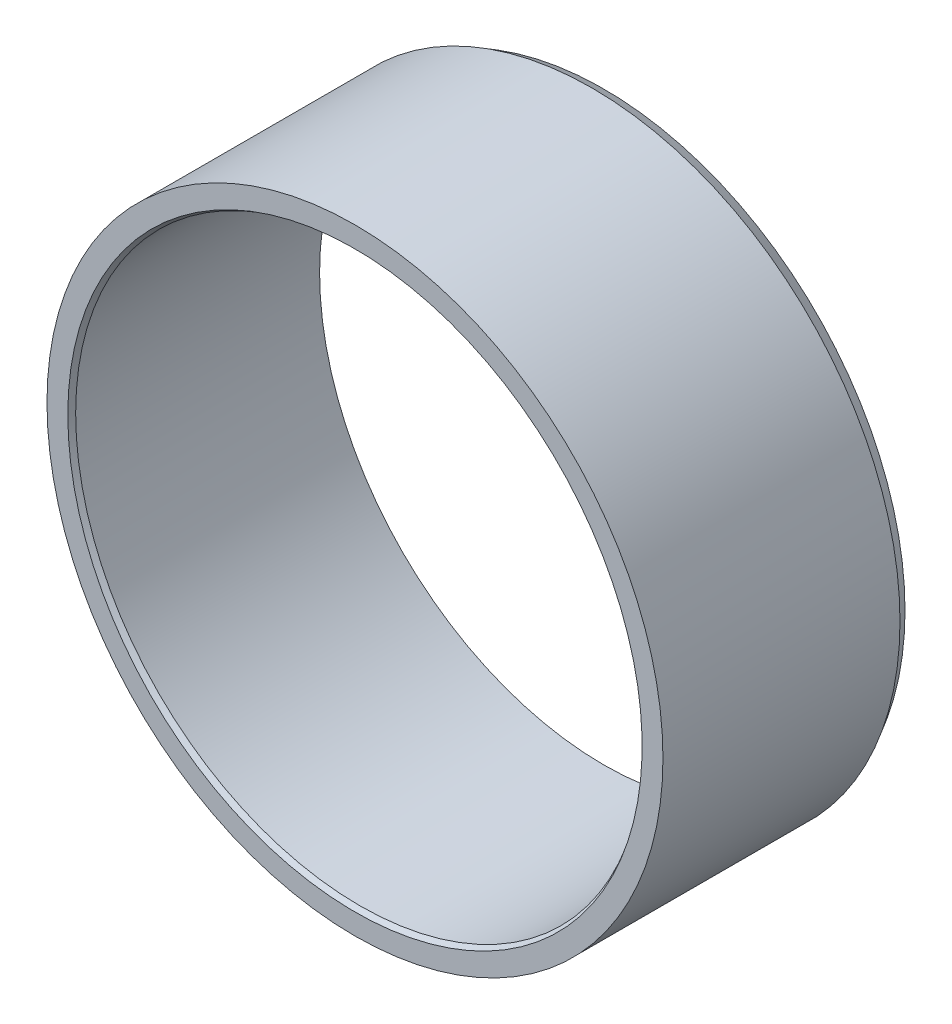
ISO-10303-21;
HEADER;
FILE_DESCRIPTION(('STEP AP214'),'2;1');
FILE_NAME('part.step','',(''),(''),'','','');
FILE_SCHEMA(('AUTOMOTIVE_DESIGN { 1 0 10303 214 1 1 1 1 }'));
ENDSEC;
DATA;
#1=APPLICATION_CONTEXT('core data for automotive mechanical design processes');
#2=APPLICATION_PROTOCOL_DEFINITION('international standard','automotive_design',2000,#1);
#3=PRODUCT_CONTEXT('',#1,'mechanical');
#4=PRODUCT('Part','Part','',(#3));
#5=PRODUCT_RELATED_PRODUCT_CATEGORY('part','',(#4));
#6=PRODUCT_DEFINITION_FORMATION('','',#4);
#7=PRODUCT_DEFINITION_CONTEXT('part definition',#1,'design');
#8=PRODUCT_DEFINITION('design','',#6,#7);
#9=PRODUCT_DEFINITION_SHAPE('','',#8);
#10=(LENGTH_UNIT() NAMED_UNIT(*) SI_UNIT(.MILLI.,.METRE.));
#11=(NAMED_UNIT(*) PLANE_ANGLE_UNIT() SI_UNIT($,.RADIAN.));
#12=(NAMED_UNIT(*) SI_UNIT($,.STERADIAN.) SOLID_ANGLE_UNIT());
#13=UNCERTAINTY_MEASURE_WITH_UNIT(LENGTH_MEASURE(1.E-05),#10,'distance_accuracy_value','');
#14=(GEOMETRIC_REPRESENTATION_CONTEXT(3) GLOBAL_UNCERTAINTY_ASSIGNED_CONTEXT((#13)) GLOBAL_UNIT_ASSIGNED_CONTEXT((#10,
#11,#12)) REPRESENTATION_CONTEXT('',''));
#15=CARTESIAN_POINT('',(0.,0.,0.));
#16=DIRECTION('',(0.,0.,1.));
#17=DIRECTION('',(1.,0.,0.));
#18=AXIS2_PLACEMENT_3D('',#15,#16,#17);
#19=CARTESIAN_POINT('',(0.,30.95625,12.5095));
#20=DIRECTION('',(0.,0.,-1.));
#21=DIRECTION('',(-1.,0.,0.));
#22=AXIS2_PLACEMENT_3D('',#19,#20,#21);
#23=PLANE('',#22);
#24=CARTESIAN_POINT('',(0.,0.,12.5095));
#25=DIRECTION('',(0.,0.,-1.));
#26=DIRECTION('',(-1.,0.,0.));
#27=AXIS2_PLACEMENT_3D('',#24,#25,#26);
#28=CIRCLE('',#27,28.8638945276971);
#29=CARTESIAN_POINT('',(-28.8638945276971,0.,12.5095));
#30=VERTEX_POINT('',#29);
#31=EDGE_CURVE('E42',#30,#30,#28,.T.);
#32=ORIENTED_EDGE('',*,*,#31,.T.);
#33=EDGE_LOOP('',(#32));
#34=FACE_BOUND('',#33,.T.);
#35=CARTESIAN_POINT('',(0.,0.,12.5095));
#36=DIRECTION('',(0.,0.,1.));
#37=DIRECTION('',(1.,0.,0.));
#38=AXIS2_PLACEMENT_3D('',#35,#36,#37);
#39=CIRCLE('',#38,30.95625);
#40=CARTESIAN_POINT('',(30.95625,0.,12.5095));
#41=VERTEX_POINT('',#40);
#42=EDGE_CURVE('E54',#41,#41,#39,.T.);
#43=ORIENTED_EDGE('',*,*,#42,.T.);
#44=EDGE_LOOP('',(#43));
#45=FACE_BOUND('',#44,.T.);
#46=ADVANCED_FACE('F31',(#34,#45),#23,.F.);
#47=CARTESIAN_POINT('',(0.,0.,0.));
#48=DIRECTION('',(0.,0.,1.));
#49=DIRECTION('',(1.,0.,0.));
#50=AXIS2_PLACEMENT_3D('',#47,#48,#49);
#51=CYLINDRICAL_SURFACE('',#50,28.575);
#52=CARTESIAN_POINT('',(0.,0.,12.00912));
#53=DIRECTION('',(0.,0.,-1.));
#54=DIRECTION('',(-1.,0.,0.));
#55=AXIS2_PLACEMENT_3D('',#52,#53,#54);
#56=CIRCLE('',#55,28.575);
#57=CARTESIAN_POINT('',(-28.575,0.,12.00912));
#58=VERTEX_POINT('',#57);
#59=EDGE_CURVE('E46',#58,#58,#56,.F.);
#60=ORIENTED_EDGE('',*,*,#59,.T.);
#61=EDGE_LOOP('',(#60));
#62=FACE_BOUND('',#61,.T.);
#63=CARTESIAN_POINT('',(0.,0.,-12.5095));
#64=DIRECTION('',(0.,0.,1.));
#65=DIRECTION('',(1.,0.,0.));
#66=AXIS2_PLACEMENT_3D('',#63,#64,#65);
#67=CIRCLE('',#66,28.575);
#68=CARTESIAN_POINT('',(28.575,0.,-12.5095));
#69=VERTEX_POINT('',#68);
#70=EDGE_CURVE('E51',#69,#69,#67,.T.);
#71=ORIENTED_EDGE('',*,*,#70,.F.);
#72=EDGE_LOOP('',(#71));
#73=FACE_BOUND('',#72,.T.);
#74=ADVANCED_FACE('F69',(#62,#73),#51,.F.);
#75=CARTESIAN_POINT('',(0.,30.95625,-12.5095));
#76=DIRECTION('',(0.,0.,1.));
#77=DIRECTION('',(1.,0.,0.));
#78=AXIS2_PLACEMENT_3D('',#75,#76,#77);
#79=PLANE('',#78);
#80=CARTESIAN_POINT('',(0.,0.,-12.5095));
#81=DIRECTION('',(0.,0.,1.));
#82=DIRECTION('',(1.,0.,0.));
#83=AXIS2_PLACEMENT_3D('',#80,#81,#82);
#84=CIRCLE('',#83,30.2670092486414);
#85=CARTESIAN_POINT('',(30.2670092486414,0.,-12.5095));
#86=VERTEX_POINT('',#85);
#87=EDGE_CURVE('E10',#86,#86,#84,.F.);
#88=ORIENTED_EDGE('',*,*,#87,.T.);
#89=EDGE_LOOP('',(#88));
#90=FACE_BOUND('',#89,.T.);
#91=ORIENTED_EDGE('',*,*,#70,.T.);
#92=EDGE_LOOP('',(#91));
#93=FACE_BOUND('',#92,.T.);
#94=ADVANCED_FACE('F62',(#90,#93),#79,.F.);
#95=CARTESIAN_POINT('',(0.,0.,0.));
#96=DIRECTION('',(0.,0.,1.));
#97=DIRECTION('',(1.,0.,0.));
#98=AXIS2_PLACEMENT_3D('',#95,#96,#97);
#99=CYLINDRICAL_SURFACE('',#98,30.95625);
#100=CARTESIAN_POINT('',(0.,0.,-11.3156999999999));
#101=DIRECTION('',(0.,0.,1.));
#102=DIRECTION('',(1.,0.,0.));
#103=AXIS2_PLACEMENT_3D('',#100,#101,#102);
#104=CIRCLE('',#103,30.95625);
#105=CARTESIAN_POINT('',(30.95625,0.,-11.3156999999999));
#106=VERTEX_POINT('',#105);
#107=EDGE_CURVE('E38',#106,#106,#104,.T.);
#108=ORIENTED_EDGE('',*,*,#107,.T.);
#109=EDGE_LOOP('',(#108));
#110=FACE_BOUND('',#109,.T.);
#111=ORIENTED_EDGE('',*,*,#42,.F.);
#112=EDGE_LOOP('',(#111));
#113=FACE_BOUND('',#112,.T.);
#114=ADVANCED_FACE('F59',(#110,#113),#99,.T.);
#115=CARTESIAN_POINT('',(0.,0.,12.00912));
#116=DIRECTION('',(0.,0.,1.));
#117=DIRECTION('',(1.,0.,0.));
#118=AXIS2_PLACEMENT_3D('',#115,#116,#117);
#119=CONICAL_SURFACE('',#118,28.575,0.523598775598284);
#120=ORIENTED_EDGE('',*,*,#31,.F.);
#121=EDGE_LOOP('',(#120));
#122=FACE_BOUND('',#121,.T.);
#123=ORIENTED_EDGE('',*,*,#59,.F.);
#124=EDGE_LOOP('',(#123));
#125=FACE_BOUND('',#124,.T.);
#126=ADVANCED_FACE('F61',(#122,#125),#119,.F.);
#127=CARTESIAN_POINT('',(0.,0.,-11.3156999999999));
#128=DIRECTION('',(0.,0.,1.));
#129=DIRECTION('',(1.,0.,0.));
#130=AXIS2_PLACEMENT_3D('',#127,#128,#129);
#131=CONICAL_SURFACE('',#130,30.95625,0.523598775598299);
#132=ORIENTED_EDGE('',*,*,#87,.F.);
#133=EDGE_LOOP('',(#132));
#134=FACE_BOUND('',#133,.T.);
#135=ORIENTED_EDGE('',*,*,#107,.F.);
#136=EDGE_LOOP('',(#135));
#137=FACE_BOUND('',#136,.T.);
#138=ADVANCED_FACE('F33',(#134,#137),#131,.T.);
#139=CLOSED_SHELL('',(#46,#74,#94,#114,#126,#138));
#140=MANIFOLD_SOLID_BREP('B2',#139);
#141=ADVANCED_BREP_SHAPE_REPRESENTATION('',(#18,#140),#14);
#142=SHAPE_DEFINITION_REPRESENTATION(#9,#141);
ENDSEC;
END-ISO-10303-21;
